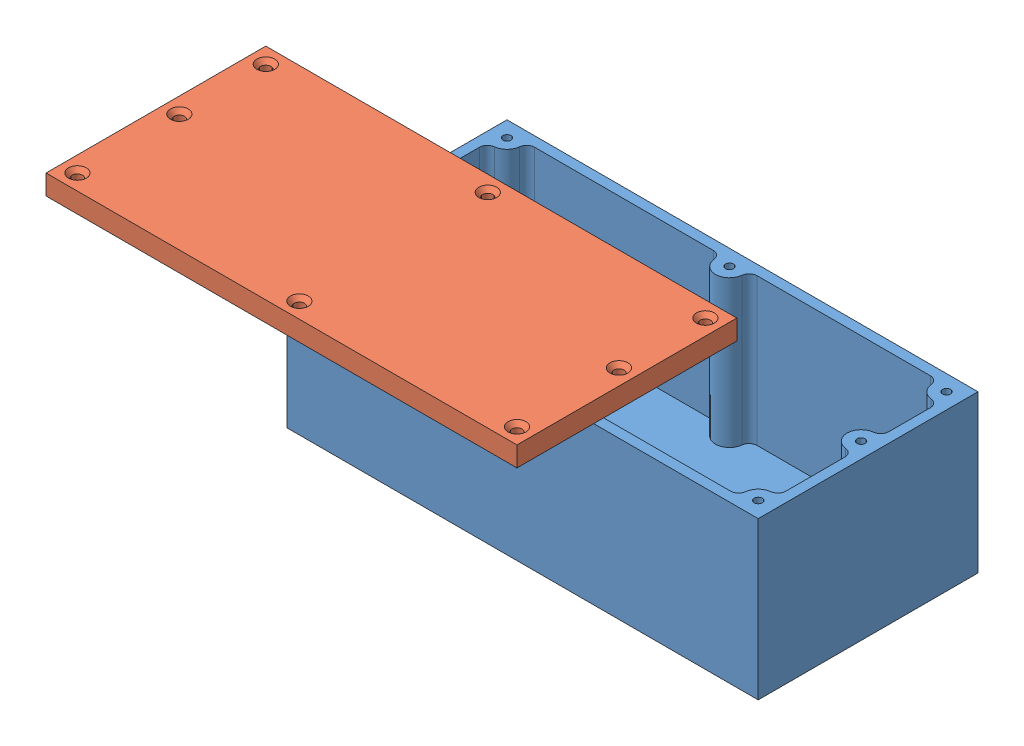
SolidWorks assembly Assem1.sldasm, configuration Default (file format 13000). Lengths in mm.
Overall size (152.83 105.91 143.99).
2 component instances, 2 part files, 0 mates.
Components (placement in the parent):
- Electronic box-1: Electronic box.SLDPRT [Default] at origin size (150 50 70)
- Electronic box lid-2: Electronic box lid.SLDPRT [Default] at (-2.8317 99.5584 73.9866) size (150 6.35 70)
